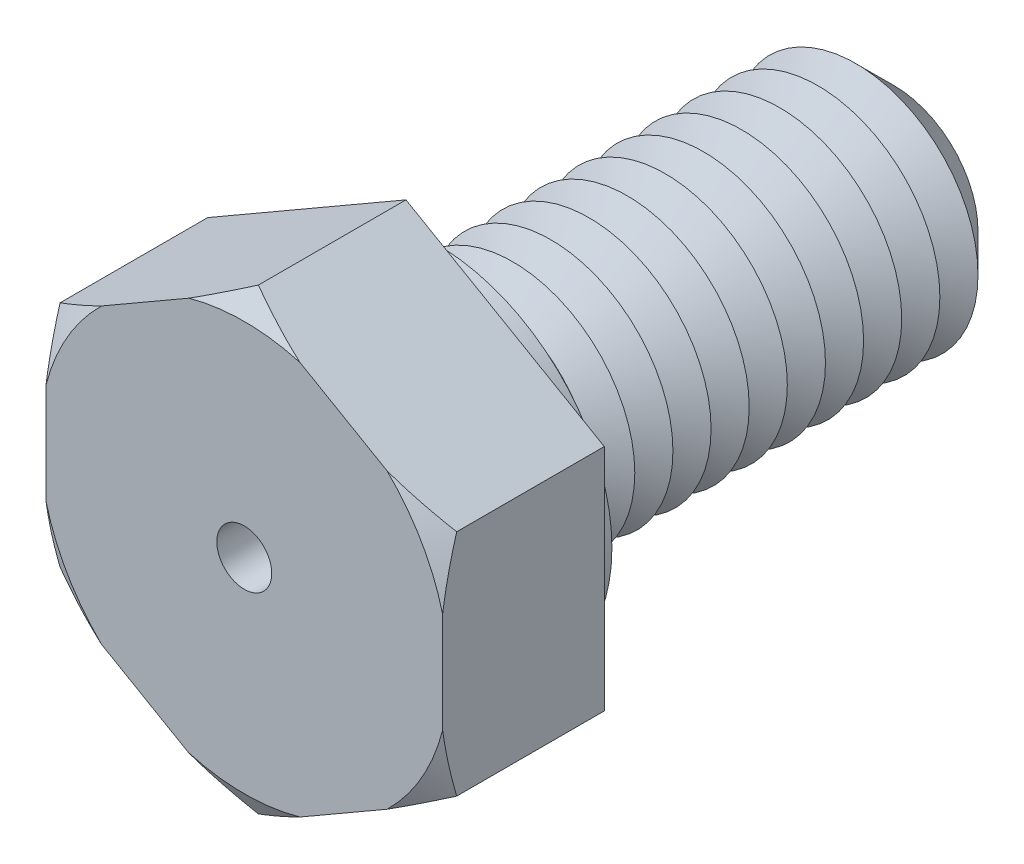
from build123d import *

# Parameters (mm, degrees)
BOSS_EXTRUDE1_DEPTH = 5.3
SKETCH3_R           = 4
BOSS_EXTRUDE2_DEPTH = 16
SKETCH4_R           = 5.75
BOSS_EXTRUDE3_DEPTH = 1
CHAMFER1_SIZE       = 1.25
LPATTERN1_COUNT     = 11
LPATTERN1_PITCH     = 1.25
SKETCH8_R           = 0.9
CUT_EXTRUDE1_DEPTH  = 21.3


with BuildPart() as part:
    # Sketch2 → Boss-Extrude1 (new body)
    with BuildSketch(Plane.XY):
        Polygon((0, 7.505553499), (-6.5, 3.75277675), (-6.5, -3.75277675), (0, -7.505553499), (6.5, -3.75277675), (6.5, 3.75277675), align=None)
    extrude(amount=BOSS_EXTRUDE1_DEPTH)

    # Sketch3 → Boss-Extrude2 (add)
    with BuildSketch(Plane(origin=(0, 0, 0), x_dir=(-1, 0, 0), z_dir=(0, 0, -1))):
        Circle(SKETCH3_R)
    extrude(amount=BOSS_EXTRUDE2_DEPTH)

    # Sketch4 → Boss-Extrude3 (add)
    with BuildSketch(Plane(origin=(0, 0, 0), x_dir=(-1, 0, 0), z_dir=(0, 0, -1))):
        with Locations(Location((0, 0, 0), (0, 0, 180))):
            Circle(SKETCH4_R)
    extrude(amount=BOSS_EXTRUDE3_DEPTH)

    # Chamfer1
    chamfer1_edges = [part.edges().sort_by_distance(p)[0] for p in [
        (4, 0, -16),
    ]]
    chamfer(chamfer1_edges, length=CHAMFER1_SIZE)

    # Sketch6 → Cut-Revolve1 (revolve, cut)
    with BuildSketch(Plane(origin=(0, 0, 0), x_dir=(0, 0, -1), z_dir=(1, 0, 0)), mode=Mode.PRIVATE) as cut_revolve1_sk:
        Polygon((1, 4), (1.625, 2.917468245), (2.25, 4), align=None)
    cut_revolve1 = revolve(cut_revolve1_sk.sketch.rotate(Axis((0, 0, 3.211670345), (0, 0, -1)), 90), axis=Axis((0, 0, 3.211670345), (0, 0, -1)), mode=Mode.SUBTRACT)

    # LPattern1: Cut-Revolve1 ×11
    with Locations(*[(0, 0, -i * LPATTERN1_PITCH) for i in range(1, LPATTERN1_COUNT)]):
        add(cut_revolve1, mode=Mode.SUBTRACT)

    # Sketch7 → Cut-Revolve2 (revolve, cut)
    with BuildSketch(Plane(origin=(0, 0, 0), x_dir=(0, 0, -1), z_dir=(1, 0, 0)), mode=Mode.PRIVATE) as cut_revolve2_sk:
        Polygon((-5.3, 7.505553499), (-5.3, 6.705553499), (-4.838119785, 7.505553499), align=None)
    revolve(cut_revolve2_sk.sketch.rotate(Axis((0, 0, 3.211670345), (0, 0, -1)), 90), axis=Axis((0, 0, 3.211670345), (0, 0, -1)), mode=Mode.SUBTRACT)

    # Sketch8 → Cut-Extrude1 (cut)
    with BuildSketch(Plane.XY.offset(5.3)):
        Circle(SKETCH8_R)
    extrude(amount=-CUT_EXTRUDE1_DEPTH, mode=Mode.SUBTRACT)


solid = part.part
